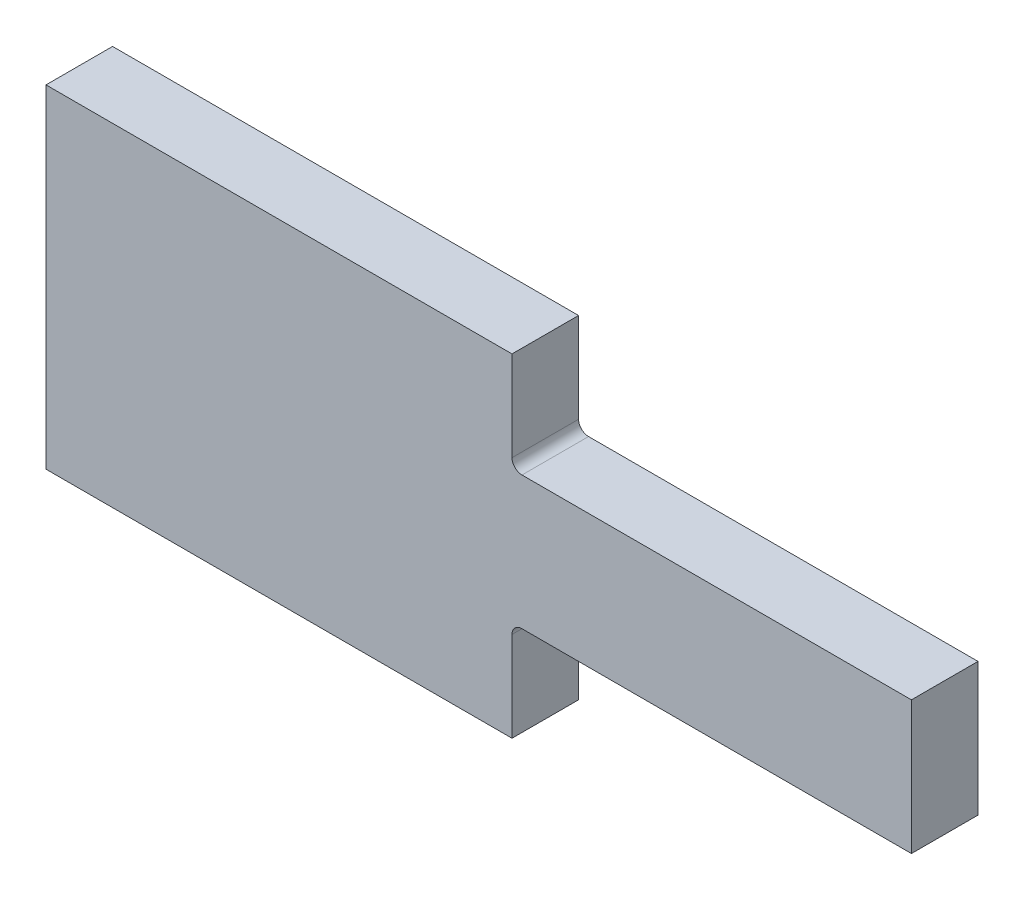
from build123d import *

# Parameters (mm, degrees)
AUFSATZ_LINEAR_AUSTRAGEN1_DEPTH = 20
VERRUNDUNG1_R                   = 3


with BuildPart() as part:
    # Skizze1 → Aufsatz-Linear austragen1 (new body)
    with BuildSketch(Plane.XY):
        Polygon((0, -50), (0, 50), (140, 50), (140, 20), (260, 20), (260, -20), (140, -20), (140, -50), align=None)
    extrude(amount=AUFSATZ_LINEAR_AUSTRAGEN1_DEPTH)

    # Verrundung1
    verrundung1_edges = [part.edges().sort_by_distance(p)[0] for p in [
        (140, 20, 10),
        (140, -20, 10),
    ]]
    fillet(verrundung1_edges, radius=VERRUNDUNG1_R)


solid = part.part
